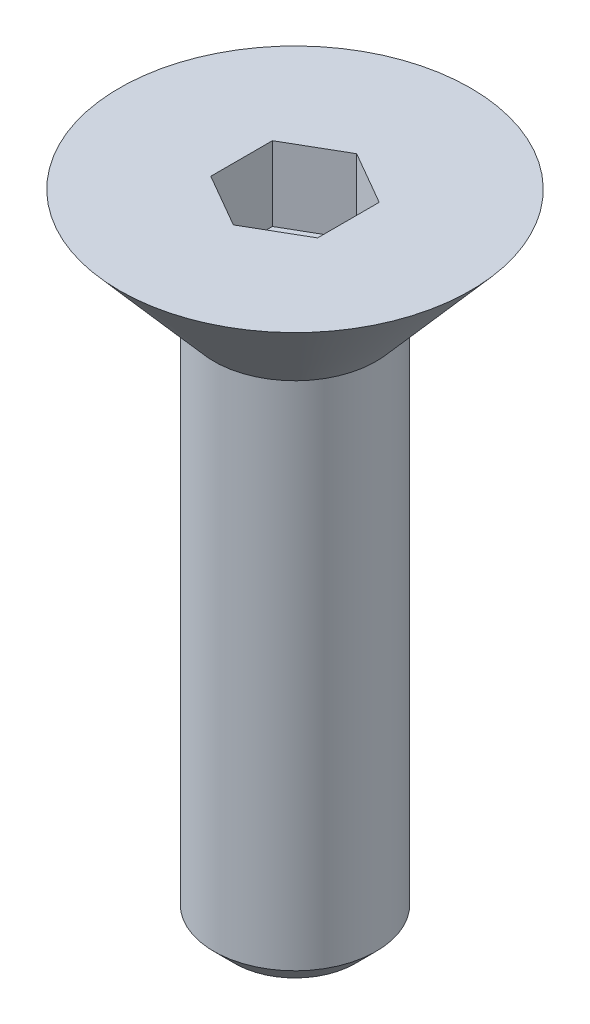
ISO-10303-21;
HEADER;
FILE_DESCRIPTION(('STEP AP214'),'2;1');
FILE_NAME('part.step','',(''),(''),'','','');
FILE_SCHEMA(('AUTOMOTIVE_DESIGN { 1 0 10303 214 1 1 1 1 }'));
ENDSEC;
DATA;
#1=APPLICATION_CONTEXT('core data for automotive mechanical design processes');
#2=APPLICATION_PROTOCOL_DEFINITION('international standard','automotive_design',2000,#1);
#3=PRODUCT_CONTEXT('',#1,'mechanical');
#4=PRODUCT('Part','Part','',(#3));
#5=PRODUCT_RELATED_PRODUCT_CATEGORY('part','',(#4));
#6=PRODUCT_DEFINITION_FORMATION('','',#4);
#7=PRODUCT_DEFINITION_CONTEXT('part definition',#1,'design');
#8=PRODUCT_DEFINITION('design','',#6,#7);
#9=PRODUCT_DEFINITION_SHAPE('','',#8);
#10=(LENGTH_UNIT() NAMED_UNIT(*) SI_UNIT(.MILLI.,.METRE.));
#11=(NAMED_UNIT(*) PLANE_ANGLE_UNIT() SI_UNIT($,.RADIAN.));
#12=(NAMED_UNIT(*) SI_UNIT($,.STERADIAN.) SOLID_ANGLE_UNIT());
#13=UNCERTAINTY_MEASURE_WITH_UNIT(LENGTH_MEASURE(1.E-05),#10,'distance_accuracy_value','');
#14=(GEOMETRIC_REPRESENTATION_CONTEXT(3) GLOBAL_UNCERTAINTY_ASSIGNED_CONTEXT((#13)) GLOBAL_UNIT_ASSIGNED_CONTEXT((#10,
#11,#12)) REPRESENTATION_CONTEXT('',''));
#15=CARTESIAN_POINT('',(0.,0.,0.));
#16=DIRECTION('',(0.,0.,1.));
#17=DIRECTION('',(1.,0.,0.));
#18=AXIS2_PLACEMENT_3D('',#15,#16,#17);
#19=CARTESIAN_POINT('',(0.,0.,0.));
#20=DIRECTION('',(0.,1.,0.));
#21=DIRECTION('',(0.,0.,1.));
#22=AXIS2_PLACEMENT_3D('',#19,#20,#21);
#23=CONICAL_SURFACE('',#22,2.413,0.716035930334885);
#24=CARTESIAN_POINT('',(0.,3.2258,0.));
#25=DIRECTION('',(0.,-1.,0.));
#26=DIRECTION('',(0.,0.,-1.));
#27=AXIS2_PLACEMENT_3D('',#24,#25,#26);
#28=CIRCLE('',#27,5.2197);
#29=CARTESIAN_POINT('',(0.,3.2258,-5.2197));
#30=VERTEX_POINT('',#29);
#31=EDGE_CURVE('E37',#30,#30,#28,.T.);
#32=ORIENTED_EDGE('',*,*,#31,.T.);
#33=EDGE_LOOP('',(#32));
#34=FACE_BOUND('',#33,.T.);
#35=CARTESIAN_POINT('',(0.,0.,0.));
#36=DIRECTION('',(0.,-1.,0.));
#37=DIRECTION('',(0.,0.,-1.));
#38=AXIS2_PLACEMENT_3D('',#35,#36,#37);
#39=CIRCLE('',#38,2.413);
#40=CARTESIAN_POINT('',(0.,0.,-2.413));
#41=VERTEX_POINT('',#40);
#42=EDGE_CURVE('E11',#41,#41,#39,.T.);
#43=ORIENTED_EDGE('',*,*,#42,.F.);
#44=EDGE_LOOP('',(#43));
#45=FACE_BOUND('',#44,.T.);
#46=ADVANCED_FACE('F30',(#34,#45),#23,.T.);
#47=CARTESIAN_POINT('',(5.2197,3.2258,0.));
#48=DIRECTION('',(0.,1.,0.));
#49=DIRECTION('',(0.,0.,1.));
#50=AXIS2_PLACEMENT_3D('',#47,#48,#49);
#51=PLANE('',#50);
#52=DIRECTION('',(1.02068673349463E-11,0.,1.));
#53=VECTOR('',#52,1.);
#54=CARTESIAN_POINT('',(-1.58750000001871,3.2258,-0.916543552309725));
#55=LINE('',#54,#53);
#56=CARTESIAN_POINT('',(-1.58750000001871,3.2258,-0.916543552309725));
#57=VERTEX_POINT('',#56);
#58=CARTESIAN_POINT('',(-1.5875,3.2258,0.916543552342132));
#59=VERTEX_POINT('',#58);
#60=EDGE_CURVE('E44',#57,#59,#55,.T.);
#61=ORIENTED_EDGE('',*,*,#60,.F.);
#62=DIRECTION('',(-0.866025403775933,0.,0.500000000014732));
#63=VECTOR('',#62,1.);
#64=CARTESIAN_POINT('',(-2.80649960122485E-11,3.2258,-1.83308710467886));
#65=LINE('',#64,#63);
#66=CARTESIAN_POINT('',(-2.80649960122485E-11,3.2258,-1.83308710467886));
#67=VERTEX_POINT('',#66);
#68=EDGE_CURVE('E114',#67,#57,#65,.T.);
#69=ORIENTED_EDGE('',*,*,#68,.F.);
#70=DIRECTION('',(-0.866025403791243,0.,-0.499999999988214));
#71=VECTOR('',#70,1.);
#72=CARTESIAN_POINT('',(1.58749999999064,3.2258,-0.916543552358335));
#73=LINE('',#72,#71);
#74=CARTESIAN_POINT('',(1.58749999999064,3.2258,-0.916543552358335));
#75=VERTEX_POINT('',#74);
#76=EDGE_CURVE('E108',#75,#67,#73,.T.);
#77=ORIENTED_EDGE('',*,*,#76,.F.);
#78=DIRECTION('',(-1.02067490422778E-11,0.,-1.));
#79=VECTOR('',#78,1.);
#80=CARTESIAN_POINT('',(1.58750000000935,3.2258,0.916543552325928));
#81=LINE('',#80,#79);
#82=CARTESIAN_POINT('',(1.58750000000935,3.2258,0.916543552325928));
#83=VERTEX_POINT('',#82);
#84=EDGE_CURVE('E106',#83,#75,#81,.T.);
#85=ORIENTED_EDGE('',*,*,#84,.F.);
#86=DIRECTION('',(0.866025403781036,0.,-0.500000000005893));
#87=VECTOR('',#86,1.);
#88=CARTESIAN_POINT('',(9.35499867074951E-12,3.2258,1.83308710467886));
#89=LINE('',#88,#87);
#90=CARTESIAN_POINT('',(9.35499867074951E-12,3.2258,1.83308710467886));
#91=VERTEX_POINT('',#90);
#92=EDGE_CURVE('E87',#91,#83,#89,.T.);
#93=ORIENTED_EDGE('',*,*,#92,.F.);
#94=DIRECTION('',(0.86602540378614,0.,0.499999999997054));
#95=VECTOR('',#94,1.);
#96=CARTESIAN_POINT('',(-1.5875,3.2258,0.916543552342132));
#97=LINE('',#96,#95);
#98=EDGE_CURVE('E98',#59,#91,#97,.T.);
#99=ORIENTED_EDGE('',*,*,#98,.F.);
#100=EDGE_LOOP('',(#61,#69,#77,#85,#93,#99));
#101=FACE_BOUND('',#100,.T.);
#102=ORIENTED_EDGE('',*,*,#31,.F.);
#103=EDGE_LOOP('',(#102));
#104=FACE_BOUND('',#103,.T.);
#105=ADVANCED_FACE('F102',(#101,#104),#51,.T.);
#106=CARTESIAN_POINT('',(0.,-15.8242,0.));
#107=DIRECTION('',(0.,-1.,0.));
#108=DIRECTION('',(0.,0.,-1.));
#109=AXIS2_PLACEMENT_3D('',#106,#107,#108);
#110=PLANE('',#109);
#111=CARTESIAN_POINT('',(0.,-15.8242,0.));
#112=DIRECTION('',(0.,-1.,0.));
#113=DIRECTION('',(0.,0.,-1.));
#114=AXIS2_PLACEMENT_3D('',#111,#112,#113);
#115=CIRCLE('',#114,1.78308);
#116=CARTESIAN_POINT('',(0.,-15.8242,-1.78308));
#117=VERTEX_POINT('',#116);
#118=EDGE_CURVE('E141',#117,#117,#115,.T.);
#119=ORIENTED_EDGE('',*,*,#118,.T.);
#120=EDGE_LOOP('',(#119));
#121=FACE_BOUND('',#120,.T.);
#122=ADVANCED_FACE('F148',(#121),#110,.T.);
#123=CARTESIAN_POINT('',(0.,-15.8242,0.));
#124=DIRECTION('',(0.,1.,0.));
#125=DIRECTION('',(0.,0.,1.));
#126=AXIS2_PLACEMENT_3D('',#123,#124,#125);
#127=CONICAL_SURFACE('',#126,1.78308,0.785398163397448);
#128=CARTESIAN_POINT('',(0.,-15.19428,0.));
#129=DIRECTION('',(0.,-1.,0.));
#130=DIRECTION('',(0.,0.,-1.));
#131=AXIS2_PLACEMENT_3D('',#128,#129,#130);
#132=CIRCLE('',#131,2.413);
#133=CARTESIAN_POINT('',(0.,-15.19428,-2.413));
#134=VERTEX_POINT('',#133);
#135=EDGE_CURVE('E132',#134,#134,#132,.T.);
#136=ORIENTED_EDGE('',*,*,#135,.T.);
#137=EDGE_LOOP('',(#136));
#138=FACE_BOUND('',#137,.T.);
#139=ORIENTED_EDGE('',*,*,#118,.F.);
#140=EDGE_LOOP('',(#139));
#141=FACE_BOUND('',#140,.T.);
#142=ADVANCED_FACE('F153',(#138,#141),#127,.T.);
#143=CARTESIAN_POINT('',(0.,0.,0.));
#144=DIRECTION('',(0.,-1.,0.));
#145=DIRECTION('',(0.,0.,-1.));
#146=AXIS2_PLACEMENT_3D('',#143,#144,#145);
#147=CYLINDRICAL_SURFACE('',#146,2.413);
#148=ORIENTED_EDGE('',*,*,#42,.T.);
#149=EDGE_LOOP('',(#148));
#150=FACE_BOUND('',#149,.T.);
#151=ORIENTED_EDGE('',*,*,#135,.F.);
#152=EDGE_LOOP('',(#151));
#153=FACE_BOUND('',#152,.T.);
#154=ADVANCED_FACE('F159',(#150,#153),#147,.T.);
#155=CARTESIAN_POINT('',(-1.58750000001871,1.016,-0.916543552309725));
#156=DIRECTION('',(-1.,0.,1.02068673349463E-11));
#157=DIRECTION('',(1.02068673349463E-11,0.,1.));
#158=AXIS2_PLACEMENT_3D('',#155,#156,#157);
#159=PLANE('',#158);
#160=ORIENTED_EDGE('',*,*,#60,.T.);
#161=DIRECTION('',(0.,1.,0.));
#162=VECTOR('',#161,1.);
#163=CARTESIAN_POINT('',(-1.5875,1.016,0.916543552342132));
#164=LINE('',#163,#162);
#165=CARTESIAN_POINT('',(-1.5875,1.016,0.916543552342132));
#166=VERTEX_POINT('',#165);
#167=EDGE_CURVE('E95',#166,#59,#164,.T.);
#168=ORIENTED_EDGE('',*,*,#167,.F.);
#169=DIRECTION('',(1.02068673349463E-11,0.,1.));
#170=VECTOR('',#169,1.);
#171=CARTESIAN_POINT('',(-1.58750000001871,1.016,-0.916543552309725));
#172=LINE('',#171,#170);
#173=CARTESIAN_POINT('',(-1.58750000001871,1.016,-0.916543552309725));
#174=VERTEX_POINT('',#173);
#175=EDGE_CURVE('E116',#174,#166,#172,.T.);
#176=ORIENTED_EDGE('',*,*,#175,.F.);
#177=DIRECTION('',(0.,1.,0.));
#178=VECTOR('',#177,1.);
#179=CARTESIAN_POINT('',(-1.58750000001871,1.016,-0.916543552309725));
#180=LINE('',#179,#178);
#181=EDGE_CURVE('E51',#174,#57,#180,.T.);
#182=ORIENTED_EDGE('',*,*,#181,.T.);
#183=EDGE_LOOP('',(#160,#168,#176,#182));
#184=FACE_BOUND('',#183,.T.);
#185=ADVANCED_FACE('F163',(#184),#159,.F.);
#186=CARTESIAN_POINT('',(-2.80649960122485E-11,1.016,-1.83308710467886));
#187=DIRECTION('',(-0.500000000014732,0.,-0.866025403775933));
#188=DIRECTION('',(-0.866025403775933,0.,0.500000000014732));
#189=AXIS2_PLACEMENT_3D('',#186,#187,#188);
#190=PLANE('',#189);
#191=ORIENTED_EDGE('',*,*,#68,.T.);
#192=ORIENTED_EDGE('',*,*,#181,.F.);
#193=DIRECTION('',(-0.866025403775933,0.,0.500000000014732));
#194=VECTOR('',#193,1.);
#195=CARTESIAN_POINT('',(-2.80649960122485E-11,1.016,-1.83308710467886));
#196=LINE('',#195,#194);
#197=CARTESIAN_POINT('',(-2.80649960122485E-11,1.016,-1.83308710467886));
#198=VERTEX_POINT('',#197);
#199=EDGE_CURVE('E128',#198,#174,#196,.T.);
#200=ORIENTED_EDGE('',*,*,#199,.F.);
#201=DIRECTION('',(0.,1.,0.));
#202=VECTOR('',#201,1.);
#203=CARTESIAN_POINT('',(-2.80649960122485E-11,1.016,-1.83308710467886));
#204=LINE('',#203,#202);
#205=EDGE_CURVE('E133',#198,#67,#204,.T.);
#206=ORIENTED_EDGE('',*,*,#205,.T.);
#207=EDGE_LOOP('',(#191,#192,#200,#206));
#208=FACE_BOUND('',#207,.T.);
#209=ADVANCED_FACE('F167',(#208),#190,.F.);
#210=CARTESIAN_POINT('',(1.58749999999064,1.016,-0.916543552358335));
#211=DIRECTION('',(0.499999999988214,0.,-0.866025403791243));
#212=DIRECTION('',(-0.866025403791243,0.,-0.499999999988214));
#213=AXIS2_PLACEMENT_3D('',#210,#211,#212);
#214=PLANE('',#213);
#215=ORIENTED_EDGE('',*,*,#76,.T.);
#216=ORIENTED_EDGE('',*,*,#205,.F.);
#217=DIRECTION('',(-0.866025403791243,0.,-0.499999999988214));
#218=VECTOR('',#217,1.);
#219=CARTESIAN_POINT('',(1.58749999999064,1.016,-0.916543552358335));
#220=LINE('',#219,#218);
#221=CARTESIAN_POINT('',(1.58749999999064,1.016,-0.916543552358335));
#222=VERTEX_POINT('',#221);
#223=EDGE_CURVE('E125',#222,#198,#220,.T.);
#224=ORIENTED_EDGE('',*,*,#223,.F.);
#225=DIRECTION('',(0.,1.,0.));
#226=VECTOR('',#225,1.);
#227=CARTESIAN_POINT('',(1.58749999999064,1.016,-0.916543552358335));
#228=LINE('',#227,#226);
#229=EDGE_CURVE('E135',#222,#75,#228,.T.);
#230=ORIENTED_EDGE('',*,*,#229,.T.);
#231=EDGE_LOOP('',(#215,#216,#224,#230));
#232=FACE_BOUND('',#231,.T.);
#233=ADVANCED_FACE('F176',(#232),#214,.F.);
#234=CARTESIAN_POINT('',(1.58750000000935,1.016,0.916543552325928));
#235=DIRECTION('',(1.,0.,-1.02067490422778E-11));
#236=DIRECTION('',(-1.02067490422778E-11,0.,-1.));
#237=AXIS2_PLACEMENT_3D('',#234,#235,#236);
#238=PLANE('',#237);
#239=ORIENTED_EDGE('',*,*,#84,.T.);
#240=ORIENTED_EDGE('',*,*,#229,.F.);
#241=DIRECTION('',(-1.02067490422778E-11,0.,-1.));
#242=VECTOR('',#241,1.);
#243=CARTESIAN_POINT('',(1.58750000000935,1.016,0.916543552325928));
#244=LINE('',#243,#242);
#245=CARTESIAN_POINT('',(1.58750000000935,1.016,0.916543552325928));
#246=VERTEX_POINT('',#245);
#247=EDGE_CURVE('E122',#246,#222,#244,.T.);
#248=ORIENTED_EDGE('',*,*,#247,.F.);
#249=DIRECTION('',(0.,1.,0.));
#250=VECTOR('',#249,1.);
#251=CARTESIAN_POINT('',(1.58750000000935,1.016,0.916543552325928));
#252=LINE('',#251,#250);
#253=EDGE_CURVE('E94',#246,#83,#252,.T.);
#254=ORIENTED_EDGE('',*,*,#253,.T.);
#255=EDGE_LOOP('',(#239,#240,#248,#254));
#256=FACE_BOUND('',#255,.T.);
#257=ADVANCED_FACE('F173',(#256),#238,.F.);
#258=CARTESIAN_POINT('',(9.35499867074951E-12,1.016,1.83308710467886));
#259=DIRECTION('',(0.500000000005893,0.,0.866025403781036));
#260=DIRECTION('',(0.866025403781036,0.,-0.500000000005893));
#261=AXIS2_PLACEMENT_3D('',#258,#259,#260);
#262=PLANE('',#261);
#263=ORIENTED_EDGE('',*,*,#92,.T.);
#264=ORIENTED_EDGE('',*,*,#253,.F.);
#265=DIRECTION('',(0.866025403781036,0.,-0.500000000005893));
#266=VECTOR('',#265,1.);
#267=CARTESIAN_POINT('',(9.35499867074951E-12,1.016,1.83308710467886));
#268=LINE('',#267,#266);
#269=CARTESIAN_POINT('',(9.35499867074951E-12,1.016,1.83308710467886));
#270=VERTEX_POINT('',#269);
#271=EDGE_CURVE('E90',#270,#246,#268,.T.);
#272=ORIENTED_EDGE('',*,*,#271,.F.);
#273=DIRECTION('',(0.,1.,0.));
#274=VECTOR('',#273,1.);
#275=CARTESIAN_POINT('',(9.35499867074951E-12,1.016,1.83308710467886));
#276=LINE('',#275,#274);
#277=EDGE_CURVE('E83',#270,#91,#276,.T.);
#278=ORIENTED_EDGE('',*,*,#277,.T.);
#279=EDGE_LOOP('',(#263,#264,#272,#278));
#280=FACE_BOUND('',#279,.T.);
#281=ADVANCED_FACE('F85',(#280),#262,.F.);
#282=CARTESIAN_POINT('',(-1.5875,1.016,0.916543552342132));
#283=DIRECTION('',(-0.499999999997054,0.,0.86602540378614));
#284=DIRECTION('',(0.86602540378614,0.,0.499999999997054));
#285=AXIS2_PLACEMENT_3D('',#282,#283,#284);
#286=PLANE('',#285);
#287=ORIENTED_EDGE('',*,*,#98,.T.);
#288=ORIENTED_EDGE('',*,*,#277,.F.);
#289=DIRECTION('',(0.86602540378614,0.,0.499999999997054));
#290=VECTOR('',#289,1.);
#291=CARTESIAN_POINT('',(-1.5875,1.016,0.916543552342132));
#292=LINE('',#291,#290);
#293=EDGE_CURVE('E119',#166,#270,#292,.T.);
#294=ORIENTED_EDGE('',*,*,#293,.F.);
#295=ORIENTED_EDGE('',*,*,#167,.T.);
#296=EDGE_LOOP('',(#287,#288,#294,#295));
#297=FACE_BOUND('',#296,.T.);
#298=ADVANCED_FACE('F99',(#297),#286,.F.);
#299=CARTESIAN_POINT('',(-1.58749999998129,1.016,2.74963065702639));
#300=DIRECTION('',(0.,1.,0.));
#301=DIRECTION('',(0.,0.,1.));
#302=AXIS2_PLACEMENT_3D('',#299,#300,#301);
#303=PLANE('',#302);
#304=ORIENTED_EDGE('',*,*,#175,.T.);
#305=ORIENTED_EDGE('',*,*,#293,.T.);
#306=ORIENTED_EDGE('',*,*,#271,.T.);
#307=ORIENTED_EDGE('',*,*,#247,.T.);
#308=ORIENTED_EDGE('',*,*,#223,.T.);
#309=ORIENTED_EDGE('',*,*,#199,.T.);
#310=EDGE_LOOP('',(#304,#305,#306,#307,#308,#309));
#311=FACE_BOUND('',#310,.T.);
#312=ADVANCED_FACE('F170',(#311),#303,.T.);
#313=CLOSED_SHELL('',(#46,#105,#122,#142,#154,#185,#209,#233,#257,#281,#298,#312));
#314=MANIFOLD_SOLID_BREP('B2',#313);
#315=ADVANCED_BREP_SHAPE_REPRESENTATION('',(#18,#314),#14);
#316=SHAPE_DEFINITION_REPRESENTATION(#9,#315);
ENDSEC;
END-ISO-10303-21;
